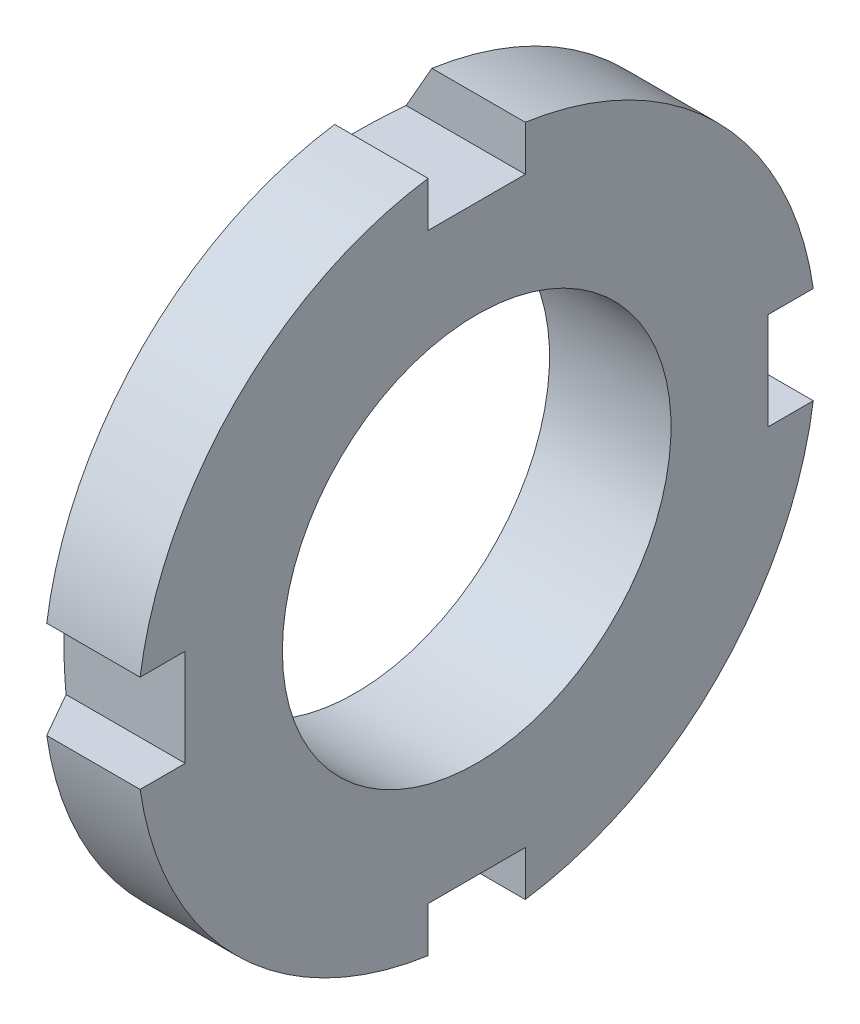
from build123d import *

# Parameters (mm, degrees)
TROU_TARAUD_M18X1_51_D       = 16
TROU_TARAUD_M18X1_51_DEPTH   = 40.5
TROU_TARAUD_M18X1_51_TIP     = 4.618802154
ESQUISSE4_W                  = 4
ESQUISSE4_H                  = 4.917862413
ENL_V_MAT_EXTRU_1_DEPTH      = 10
R_P_TITION_CIRCULAIRE1_COUNT = 4


with BuildPart() as part:
    # Esquisse1 → R_volution1 (revolve)
    with BuildSketch(Plane.XY, mode=Mode.PRIVATE) as r_volution1_sk:
        Polygon((0, 0), (0, 12), (1.154700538, 14), (5, 14), (5, 0), align=None)
    revolve(r_volution1_sk.sketch.rotate(Axis((0, 0, 0), (1, 0, 0)), 90), axis=Axis((0, 0, 0), (1, 0, 0)))

    # Trou taraud_ M18x1.51
    with Locations(Plane.ZY):
        with Locations((0, 0)):
            Hole(TROU_TARAUD_M18X1_51_D / 2, depth=TROU_TARAUD_M18X1_51_DEPTH)
            with Locations((0, 0, -(TROU_TARAUD_M18X1_51_DEPTH + TROU_TARAUD_M18X1_51_TIP / 2))):  # 120° drill point
                Cone(0, TROU_TARAUD_M18X1_51_D / 2, TROU_TARAUD_M18X1_51_TIP, mode=Mode.SUBTRACT)

    # Esquisse4 → Enl_v. mat.-Extru.1 (cut)
    with BuildSketch(Plane(origin=(5, 0, 0), x_dir=(0, 0, -1), z_dir=(1, 0, 0))):
        with Locations((0, 14.458931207)):
            Rectangle(ESQUISSE4_W, ESQUISSE4_H)
    enl_v_mat_extru_1 = extrude(amount=-ENL_V_MAT_EXTRU_1_DEPTH, mode=Mode.SUBTRACT)

    # R_p_tition circulaire1: Enl_v. mat.-Extru.1 ×4 about axis
    r_p_tition_circulaire1_axis = Axis((0, 0, 0), (1, 0, 0))
    for i in range(1, R_P_TITION_CIRCULAIRE1_COUNT):
        add(enl_v_mat_extru_1.rotate(r_p_tition_circulaire1_axis, i * 360 / R_P_TITION_CIRCULAIRE1_COUNT), mode=Mode.SUBTRACT)


solid = part.part
